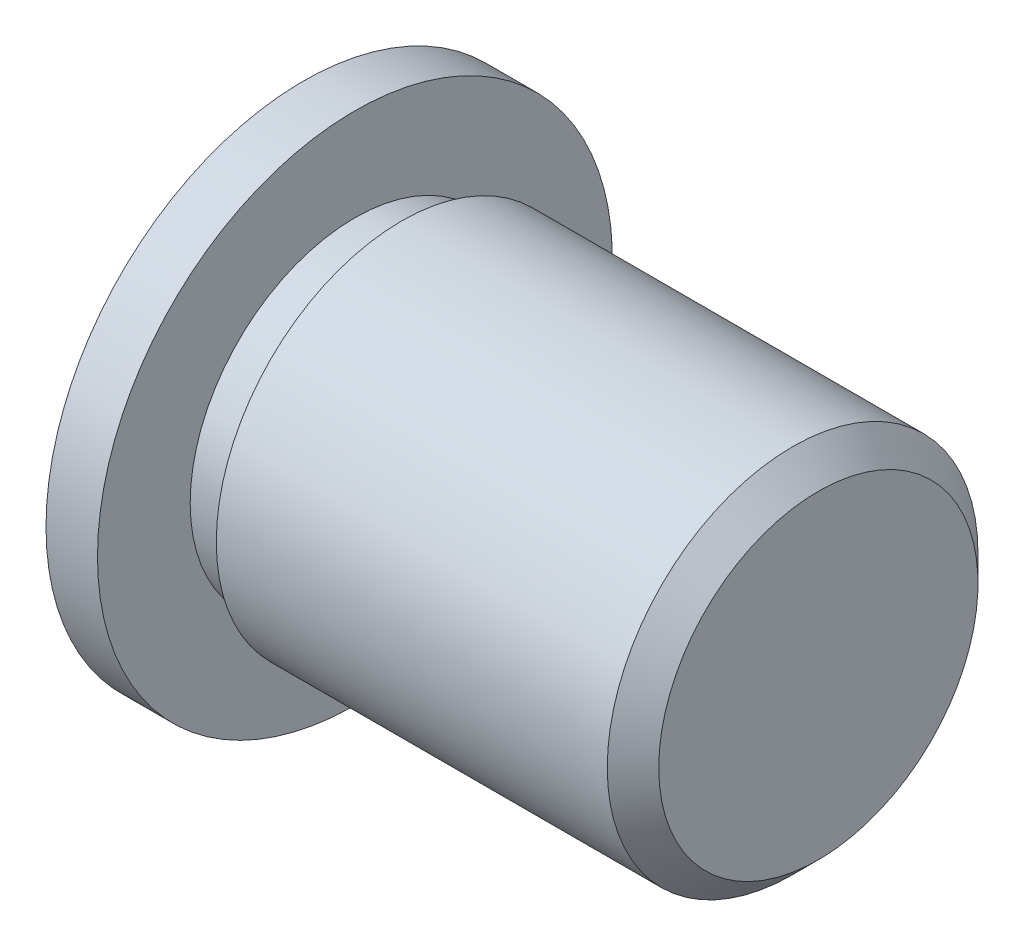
from build123d import *


with BuildPart() as part:
    # Skizze1 → Rotation1 (revolve)
    with BuildSketch(Plane.XY, mode=Mode.PRIVATE) as rotation1_sk:
        Polygon((0, 0), (0, 25), (5, 25), (5, 16), (9, 16), (9.535898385, 18), (47.5, 18), (50, 15.5), (50, 0), align=None)
    revolve(rotation1_sk.sketch.rotate(Axis((0, 0, 0), (1, 0, 0)), 90), axis=Axis((0, 0, 0), (1, 0, 0)))


solid = part.part
